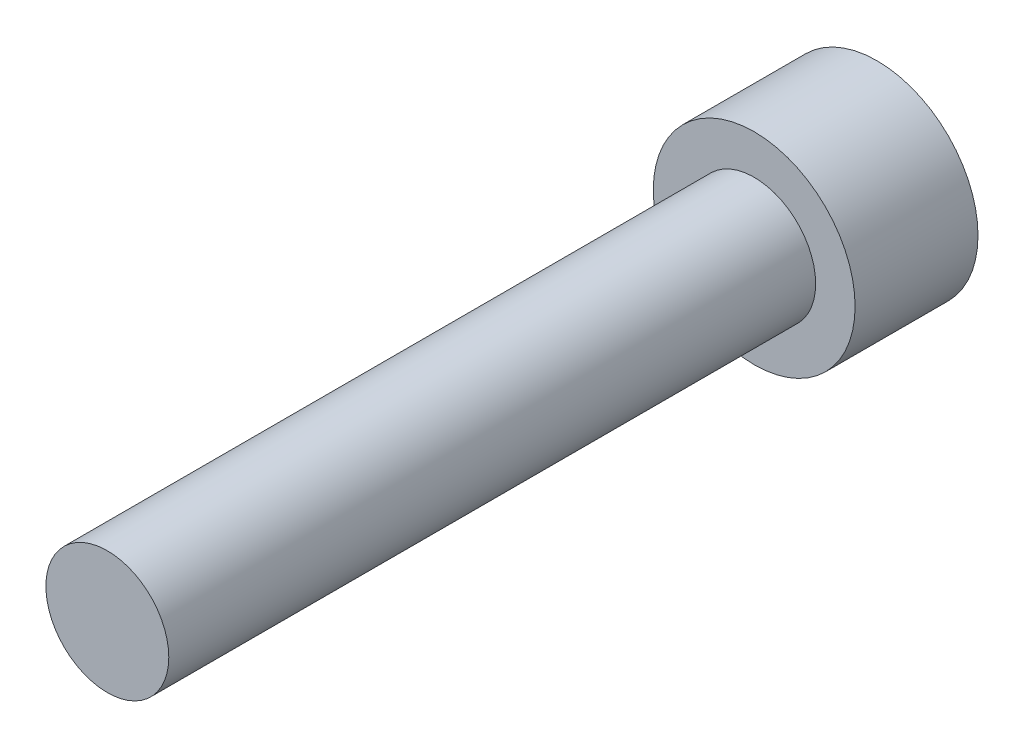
ISO-10303-21;
HEADER;
FILE_DESCRIPTION(('STEP AP214'),'2;1');
FILE_NAME('part.step','',(''),(''),'','','');
FILE_SCHEMA(('AUTOMOTIVE_DESIGN { 1 0 10303 214 1 1 1 1 }'));
ENDSEC;
DATA;
#1=APPLICATION_CONTEXT('core data for automotive mechanical design processes');
#2=APPLICATION_PROTOCOL_DEFINITION('international standard','automotive_design',2000,#1);
#3=PRODUCT_CONTEXT('',#1,'mechanical');
#4=PRODUCT('Part','Part','',(#3));
#5=PRODUCT_RELATED_PRODUCT_CATEGORY('part','',(#4));
#6=PRODUCT_DEFINITION_FORMATION('','',#4);
#7=PRODUCT_DEFINITION_CONTEXT('part definition',#1,'design');
#8=PRODUCT_DEFINITION('design','',#6,#7);
#9=PRODUCT_DEFINITION_SHAPE('','',#8);
#10=(LENGTH_UNIT() NAMED_UNIT(*) SI_UNIT(.MILLI.,.METRE.));
#11=(NAMED_UNIT(*) PLANE_ANGLE_UNIT() SI_UNIT($,.RADIAN.));
#12=(NAMED_UNIT(*) SI_UNIT($,.STERADIAN.) SOLID_ANGLE_UNIT());
#13=UNCERTAINTY_MEASURE_WITH_UNIT(LENGTH_MEASURE(1.E-05),#10,'distance_accuracy_value','');
#14=(GEOMETRIC_REPRESENTATION_CONTEXT(3) GLOBAL_UNCERTAINTY_ASSIGNED_CONTEXT((#13)) GLOBAL_UNIT_ASSIGNED_CONTEXT((#10,
#11,#12)) REPRESENTATION_CONTEXT('',''));
#15=CARTESIAN_POINT('',(0.,0.,0.));
#16=DIRECTION('',(0.,0.,1.));
#17=DIRECTION('',(1.,0.,0.));
#18=AXIS2_PLACEMENT_3D('',#15,#16,#17);
#19=CARTESIAN_POINT('',(0.,0.,25.4));
#20=DIRECTION('',(0.,0.,1.));
#21=DIRECTION('',(1.,0.,0.));
#22=AXIS2_PLACEMENT_3D('',#19,#20,#21);
#23=PLANE('',#22);
#24=CARTESIAN_POINT('',(0.,0.,25.4));
#25=DIRECTION('',(0.,0.,1.));
#26=DIRECTION('',(1.,0.,0.));
#27=AXIS2_PLACEMENT_3D('',#24,#25,#26);
#28=CIRCLE('',#27,2.413);
#29=CARTESIAN_POINT('',(2.413,0.,25.4));
#30=VERTEX_POINT('',#29);
#31=EDGE_CURVE('E11',#30,#30,#28,.T.);
#32=ORIENTED_EDGE('',*,*,#31,.T.);
#33=EDGE_LOOP('',(#32));
#34=FACE_BOUND('',#33,.T.);
#35=ADVANCED_FACE('F37',(#34),#23,.T.);
#36=CARTESIAN_POINT('',(0.,0.,25.4));
#37=DIRECTION('',(0.,0.,1.));
#38=DIRECTION('',(1.,0.,0.));
#39=AXIS2_PLACEMENT_3D('',#36,#37,#38);
#40=CYLINDRICAL_SURFACE('',#39,2.413);
#41=CARTESIAN_POINT('',(0.,0.,0.));
#42=DIRECTION('',(0.,0.,1.));
#43=DIRECTION('',(1.,0.,0.));
#44=AXIS2_PLACEMENT_3D('',#41,#42,#43);
#45=CIRCLE('',#44,2.413);
#46=CARTESIAN_POINT('',(2.413,0.,0.));
#47=VERTEX_POINT('',#46);
#48=EDGE_CURVE('E44',#47,#47,#45,.T.);
#49=ORIENTED_EDGE('',*,*,#48,.T.);
#50=EDGE_LOOP('',(#49));
#51=FACE_BOUND('',#50,.T.);
#52=ORIENTED_EDGE('',*,*,#31,.F.);
#53=EDGE_LOOP('',(#52));
#54=FACE_BOUND('',#53,.T.);
#55=ADVANCED_FACE('F151',(#51,#54),#40,.T.);
#56=CARTESIAN_POINT('',(0.,-2.413,0.));
#57=DIRECTION('',(0.,0.,1.));
#58=DIRECTION('',(1.,0.,0.));
#59=AXIS2_PLACEMENT_3D('',#56,#57,#58);
#60=PLANE('',#59);
#61=CARTESIAN_POINT('',(0.,0.,0.));
#62=DIRECTION('',(0.,0.,1.));
#63=DIRECTION('',(1.,0.,0.));
#64=AXIS2_PLACEMENT_3D('',#61,#62,#63);
#65=CIRCLE('',#64,3.9624);
#66=CARTESIAN_POINT('',(3.9624,0.,0.));
#67=VERTEX_POINT('',#66);
#68=EDGE_CURVE('E146',#67,#67,#65,.T.);
#69=ORIENTED_EDGE('',*,*,#68,.T.);
#70=EDGE_LOOP('',(#69));
#71=FACE_BOUND('',#70,.T.);
#72=ORIENTED_EDGE('',*,*,#48,.F.);
#73=EDGE_LOOP('',(#72));
#74=FACE_BOUND('',#73,.T.);
#75=ADVANCED_FACE('F154',(#71,#74),#60,.T.);
#76=CARTESIAN_POINT('',(0.,0.,25.4));
#77=DIRECTION('',(0.,0.,1.));
#78=DIRECTION('',(1.,0.,0.));
#79=AXIS2_PLACEMENT_3D('',#76,#77,#78);
#80=CYLINDRICAL_SURFACE('',#79,3.9624);
#81=CARTESIAN_POINT('',(0.,0.,-4.826));
#82=DIRECTION('',(0.,0.,1.));
#83=DIRECTION('',(1.,0.,0.));
#84=AXIS2_PLACEMENT_3D('',#81,#82,#83);
#85=CIRCLE('',#84,3.9624);
#86=CARTESIAN_POINT('',(3.9624,0.,-4.826));
#87=VERTEX_POINT('',#86);
#88=EDGE_CURVE('E138',#87,#87,#85,.T.);
#89=ORIENTED_EDGE('',*,*,#88,.T.);
#90=EDGE_LOOP('',(#89));
#91=FACE_BOUND('',#90,.T.);
#92=ORIENTED_EDGE('',*,*,#68,.F.);
#93=EDGE_LOOP('',(#92));
#94=FACE_BOUND('',#93,.T.);
#95=ADVANCED_FACE('F156',(#91,#94),#80,.T.);
#96=CARTESIAN_POINT('',(0.,-3.9624,-4.826));
#97=DIRECTION('',(0.,0.,-1.));
#98=DIRECTION('',(-1.,0.,0.));
#99=AXIS2_PLACEMENT_3D('',#96,#97,#98);
#100=PLANE('',#99);
#101=DIRECTION('',(0.866025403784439,-0.5,0.));
#102=VECTOR('',#101,1.);
#103=CARTESIAN_POINT('',(0.,2.28769270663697,-4.826));
#104=LINE('',#103,#102);
#105=CARTESIAN_POINT('',(0.,2.28769270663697,-4.826));
#106=VERTEX_POINT('',#105);
#107=CARTESIAN_POINT('',(1.9812,1.14384635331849,-4.826));
#108=VERTEX_POINT('',#107);
#109=EDGE_CURVE('E51',#106,#108,#104,.T.);
#110=ORIENTED_EDGE('',*,*,#109,.F.);
#111=DIRECTION('',(0.866025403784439,0.5,0.));
#112=VECTOR('',#111,1.);
#113=CARTESIAN_POINT('',(-1.9812,1.14384635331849,-4.826));
#114=LINE('',#113,#112);
#115=CARTESIAN_POINT('',(-1.9812,1.14384635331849,-4.826));
#116=VERTEX_POINT('',#115);
#117=EDGE_CURVE('E134',#116,#106,#114,.T.);
#118=ORIENTED_EDGE('',*,*,#117,.F.);
#119=DIRECTION('',(0.,1.,0.));
#120=VECTOR('',#119,1.);
#121=CARTESIAN_POINT('',(-1.9812,-1.14384635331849,-4.826));
#122=LINE('',#121,#120);
#123=CARTESIAN_POINT('',(-1.9812,-1.14384635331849,-4.826));
#124=VERTEX_POINT('',#123);
#125=EDGE_CURVE('E132',#124,#116,#122,.T.);
#126=ORIENTED_EDGE('',*,*,#125,.F.);
#127=DIRECTION('',(-0.866025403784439,0.5,0.));
#128=VECTOR('',#127,1.);
#129=CARTESIAN_POINT('',(0.,-2.28769270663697,-4.826));
#130=LINE('',#129,#128);
#131=CARTESIAN_POINT('',(0.,-2.28769270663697,-4.826));
#132=VERTEX_POINT('',#131);
#133=EDGE_CURVE('E99',#132,#124,#130,.T.);
#134=ORIENTED_EDGE('',*,*,#133,.F.);
#135=DIRECTION('',(-0.866025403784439,-0.5,0.));
#136=VECTOR('',#135,1.);
#137=CARTESIAN_POINT('',(1.9812,-1.14384635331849,-4.826));
#138=LINE('',#137,#136);
#139=CARTESIAN_POINT('',(1.9812,-1.14384635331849,-4.826));
#140=VERTEX_POINT('',#139);
#141=EDGE_CURVE('E128',#140,#132,#138,.T.);
#142=ORIENTED_EDGE('',*,*,#141,.F.);
#143=DIRECTION('',(0.,-1.,0.));
#144=VECTOR('',#143,1.);
#145=CARTESIAN_POINT('',(1.9812,1.14384635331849,-4.826));
#146=LINE('',#145,#144);
#147=EDGE_CURVE('E125',#108,#140,#146,.T.);
#148=ORIENTED_EDGE('',*,*,#147,.F.);
#149=EDGE_LOOP('',(#110,#118,#126,#134,#142,#148));
#150=FACE_BOUND('',#149,.T.);
#151=ORIENTED_EDGE('',*,*,#88,.F.);
#152=EDGE_LOOP('',(#151));
#153=FACE_BOUND('',#152,.T.);
#154=ADVANCED_FACE('F163',(#150,#153),#100,.T.);
#155=CARTESIAN_POINT('',(0.,2.28769270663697,-1.778));
#156=DIRECTION('',(0.5,0.866025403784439,0.));
#157=DIRECTION('',(-0.866025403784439,0.5,0.));
#158=AXIS2_PLACEMENT_3D('',#155,#156,#157);
#159=PLANE('',#158);
#160=ORIENTED_EDGE('',*,*,#109,.T.);
#161=DIRECTION('',(0.,0.,-1.));
#162=VECTOR('',#161,1.);
#163=CARTESIAN_POINT('',(1.9812,1.14384635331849,-1.778));
#164=LINE('',#163,#162);
#165=CARTESIAN_POINT('',(1.9812,1.14384635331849,-1.778));
#166=VERTEX_POINT('',#165);
#167=EDGE_CURVE('E81',#166,#108,#164,.T.);
#168=ORIENTED_EDGE('',*,*,#167,.F.);
#169=DIRECTION('',(0.866025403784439,-0.5,0.));
#170=VECTOR('',#169,1.);
#171=CARTESIAN_POINT('',(0.,2.28769270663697,-1.778));
#172=LINE('',#171,#170);
#173=CARTESIAN_POINT('',(0.,2.28769270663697,-1.778));
#174=VERTEX_POINT('',#173);
#175=EDGE_CURVE('E136',#174,#166,#172,.T.);
#176=ORIENTED_EDGE('',*,*,#175,.F.);
#177=DIRECTION('',(0.,0.,-1.));
#178=VECTOR('',#177,1.);
#179=CARTESIAN_POINT('',(0.,2.28769270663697,-1.778));
#180=LINE('',#179,#178);
#181=EDGE_CURVE('E59',#174,#106,#180,.T.);
#182=ORIENTED_EDGE('',*,*,#181,.T.);
#183=EDGE_LOOP('',(#160,#168,#176,#182));
#184=FACE_BOUND('',#183,.T.);
#185=ADVANCED_FACE('F197',(#184),#159,.F.);
#186=CARTESIAN_POINT('',(-1.9812,1.14384635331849,-1.778));
#187=DIRECTION('',(-0.5,0.866025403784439,0.));
#188=DIRECTION('',(-0.866025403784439,-0.5,0.));
#189=AXIS2_PLACEMENT_3D('',#186,#187,#188);
#190=PLANE('',#189);
#191=ORIENTED_EDGE('',*,*,#117,.T.);
#192=ORIENTED_EDGE('',*,*,#181,.F.);
#193=DIRECTION('',(0.866025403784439,0.5,0.));
#194=VECTOR('',#193,1.);
#195=CARTESIAN_POINT('',(-1.9812,1.14384635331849,-1.778));
#196=LINE('',#195,#194);
#197=CARTESIAN_POINT('',(-1.9812,1.14384635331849,-1.778));
#198=VERTEX_POINT('',#197);
#199=EDGE_CURVE('E111',#198,#174,#196,.T.);
#200=ORIENTED_EDGE('',*,*,#199,.F.);
#201=DIRECTION('',(0.,0.,-1.));
#202=VECTOR('',#201,1.);
#203=CARTESIAN_POINT('',(-1.9812,1.14384635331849,-1.778));
#204=LINE('',#203,#202);
#205=EDGE_CURVE('E103',#198,#116,#204,.T.);
#206=ORIENTED_EDGE('',*,*,#205,.T.);
#207=EDGE_LOOP('',(#191,#192,#200,#206));
#208=FACE_BOUND('',#207,.T.);
#209=ADVANCED_FACE('F208',(#208),#190,.F.);
#210=CARTESIAN_POINT('',(-1.9812,-1.14384635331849,-1.778));
#211=DIRECTION('',(-1.,0.,0.));
#212=DIRECTION('',(0.,-1.,0.));
#213=AXIS2_PLACEMENT_3D('',#210,#211,#212);
#214=PLANE('',#213);
#215=ORIENTED_EDGE('',*,*,#125,.T.);
#216=ORIENTED_EDGE('',*,*,#205,.F.);
#217=DIRECTION('',(0.,1.,0.));
#218=VECTOR('',#217,1.);
#219=CARTESIAN_POINT('',(-1.9812,-1.14384635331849,-1.778));
#220=LINE('',#219,#218);
#221=CARTESIAN_POINT('',(-1.9812,-1.14384635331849,-1.778));
#222=VERTEX_POINT('',#221);
#223=EDGE_CURVE('E107',#222,#198,#220,.T.);
#224=ORIENTED_EDGE('',*,*,#223,.F.);
#225=DIRECTION('',(0.,0.,-1.));
#226=VECTOR('',#225,1.);
#227=CARTESIAN_POINT('',(-1.9812,-1.14384635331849,-1.778));
#228=LINE('',#227,#226);
#229=EDGE_CURVE('E92',#222,#124,#228,.T.);
#230=ORIENTED_EDGE('',*,*,#229,.T.);
#231=EDGE_LOOP('',(#215,#216,#224,#230));
#232=FACE_BOUND('',#231,.T.);
#233=ADVANCED_FACE('F108',(#232),#214,.F.);
#234=CARTESIAN_POINT('',(0.,-2.28769270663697,-1.778));
#235=DIRECTION('',(-0.5,-0.866025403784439,0.));
#236=DIRECTION('',(0.866025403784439,-0.5,0.));
#237=AXIS2_PLACEMENT_3D('',#234,#235,#236);
#238=PLANE('',#237);
#239=ORIENTED_EDGE('',*,*,#133,.T.);
#240=ORIENTED_EDGE('',*,*,#229,.F.);
#241=DIRECTION('',(-0.866025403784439,0.5,0.));
#242=VECTOR('',#241,1.);
#243=CARTESIAN_POINT('',(0.,-2.28769270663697,-1.778));
#244=LINE('',#243,#242);
#245=CARTESIAN_POINT('',(0.,-2.28769270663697,-1.778));
#246=VERTEX_POINT('',#245);
#247=EDGE_CURVE('E96',#246,#222,#244,.T.);
#248=ORIENTED_EDGE('',*,*,#247,.F.);
#249=DIRECTION('',(0.,0.,-1.));
#250=VECTOR('',#249,1.);
#251=CARTESIAN_POINT('',(0.,-2.28769270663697,-1.778));
#252=LINE('',#251,#250);
#253=EDGE_CURVE('E104',#246,#132,#252,.T.);
#254=ORIENTED_EDGE('',*,*,#253,.T.);
#255=EDGE_LOOP('',(#239,#240,#248,#254));
#256=FACE_BOUND('',#255,.T.);
#257=ADVANCED_FACE('F94',(#256),#238,.F.);
#258=CARTESIAN_POINT('',(1.9812,-1.14384635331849,-1.778));
#259=DIRECTION('',(0.5,-0.866025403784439,0.));
#260=DIRECTION('',(0.866025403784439,0.5,0.));
#261=AXIS2_PLACEMENT_3D('',#258,#259,#260);
#262=PLANE('',#261);
#263=ORIENTED_EDGE('',*,*,#141,.T.);
#264=ORIENTED_EDGE('',*,*,#253,.F.);
#265=DIRECTION('',(-0.866025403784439,-0.5,0.));
#266=VECTOR('',#265,1.);
#267=CARTESIAN_POINT('',(1.9812,-1.14384635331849,-1.778));
#268=LINE('',#267,#266);
#269=CARTESIAN_POINT('',(1.9812,-1.14384635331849,-1.778));
#270=VERTEX_POINT('',#269);
#271=EDGE_CURVE('E117',#270,#246,#268,.T.);
#272=ORIENTED_EDGE('',*,*,#271,.F.);
#273=DIRECTION('',(0.,0.,-1.));
#274=VECTOR('',#273,1.);
#275=CARTESIAN_POINT('',(1.9812,-1.14384635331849,-1.778));
#276=LINE('',#275,#274);
#277=EDGE_CURVE('E141',#270,#140,#276,.T.);
#278=ORIENTED_EDGE('',*,*,#277,.T.);
#279=EDGE_LOOP('',(#263,#264,#272,#278));
#280=FACE_BOUND('',#279,.T.);
#281=ADVANCED_FACE('F236',(#280),#262,.F.);
#282=CARTESIAN_POINT('',(1.9812,1.14384635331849,-1.778));
#283=DIRECTION('',(1.,0.,0.));
#284=DIRECTION('',(0.,0.,-1.));
#285=AXIS2_PLACEMENT_3D('',#282,#283,#284);
#286=PLANE('',#285);
#287=ORIENTED_EDGE('',*,*,#147,.T.);
#288=ORIENTED_EDGE('',*,*,#277,.F.);
#289=DIRECTION('',(0.,-1.,0.));
#290=VECTOR('',#289,1.);
#291=CARTESIAN_POINT('',(1.9812,1.14384635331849,-1.778));
#292=LINE('',#291,#290);
#293=EDGE_CURVE('E119',#166,#270,#292,.T.);
#294=ORIENTED_EDGE('',*,*,#293,.F.);
#295=ORIENTED_EDGE('',*,*,#167,.T.);
#296=EDGE_LOOP('',(#287,#288,#294,#295));
#297=FACE_BOUND('',#296,.T.);
#298=ADVANCED_FACE('F246',(#297),#286,.F.);
#299=CARTESIAN_POINT('',(3.9624,0.,-1.778));
#300=DIRECTION('',(0.,0.,-1.));
#301=DIRECTION('',(-1.,0.,0.));
#302=AXIS2_PLACEMENT_3D('',#299,#300,#301);
#303=PLANE('',#302);
#304=ORIENTED_EDGE('',*,*,#175,.T.);
#305=ORIENTED_EDGE('',*,*,#293,.T.);
#306=ORIENTED_EDGE('',*,*,#271,.T.);
#307=ORIENTED_EDGE('',*,*,#247,.T.);
#308=ORIENTED_EDGE('',*,*,#223,.T.);
#309=ORIENTED_EDGE('',*,*,#199,.T.);
#310=EDGE_LOOP('',(#304,#305,#306,#307,#308,#309));
#311=FACE_BOUND('',#310,.T.);
#312=ADVANCED_FACE('F114',(#311),#303,.T.);
#313=CLOSED_SHELL('',(#35,#55,#75,#95,#154,#185,#209,#233,#257,#281,#298,#312));
#314=MANIFOLD_SOLID_BREP('B2',#313);
#315=ADVANCED_BREP_SHAPE_REPRESENTATION('',(#18,#314),#14);
#316=SHAPE_DEFINITION_REPRESENTATION(#9,#315);
ENDSEC;
END-ISO-10303-21;
